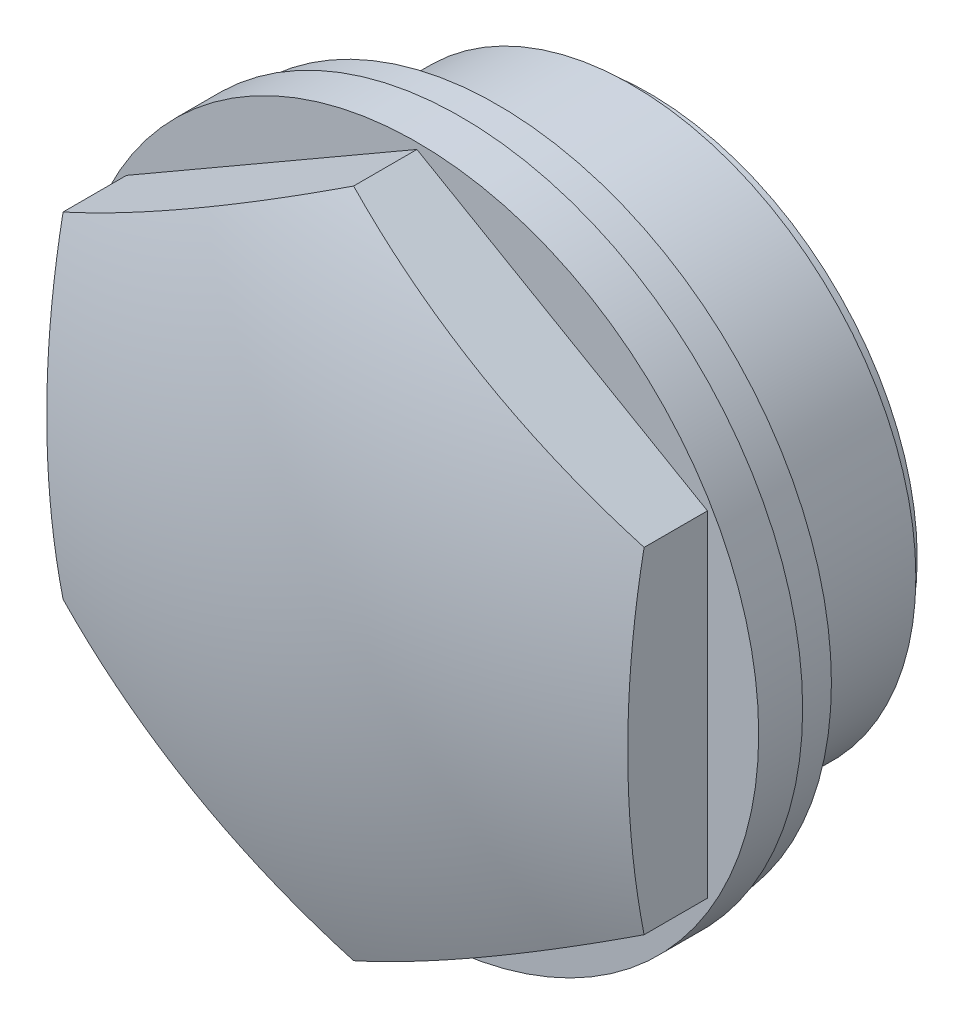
ISO-10303-21;
HEADER;
FILE_DESCRIPTION(('STEP AP214'),'2;1');
FILE_NAME('part.step','',(''),(''),'','','');
FILE_SCHEMA(('AUTOMOTIVE_DESIGN { 1 0 10303 214 1 1 1 1 }'));
ENDSEC;
DATA;
#1=APPLICATION_CONTEXT('core data for automotive mechanical design processes');
#2=APPLICATION_PROTOCOL_DEFINITION('international standard','automotive_design',2000,#1);
#3=PRODUCT_CONTEXT('',#1,'mechanical');
#4=PRODUCT('Part','Part','',(#3));
#5=PRODUCT_RELATED_PRODUCT_CATEGORY('part','',(#4));
#6=PRODUCT_DEFINITION_FORMATION('','',#4);
#7=PRODUCT_DEFINITION_CONTEXT('part definition',#1,'design');
#8=PRODUCT_DEFINITION('design','',#6,#7);
#9=PRODUCT_DEFINITION_SHAPE('','',#8);
#10=(LENGTH_UNIT() NAMED_UNIT(*) SI_UNIT(.MILLI.,.METRE.));
#11=(NAMED_UNIT(*) PLANE_ANGLE_UNIT() SI_UNIT($,.RADIAN.));
#12=(NAMED_UNIT(*) SI_UNIT($,.STERADIAN.) SOLID_ANGLE_UNIT());
#13=UNCERTAINTY_MEASURE_WITH_UNIT(LENGTH_MEASURE(1.E-05),#10,'distance_accuracy_value','');
#14=(GEOMETRIC_REPRESENTATION_CONTEXT(3) GLOBAL_UNCERTAINTY_ASSIGNED_CONTEXT((#13)) GLOBAL_UNIT_ASSIGNED_CONTEXT((#10,
#11,#12)) REPRESENTATION_CONTEXT('',''));
#15=CARTESIAN_POINT('',(0.,0.,0.));
#16=DIRECTION('',(0.,0.,1.));
#17=DIRECTION('',(1.,0.,0.));
#18=AXIS2_PLACEMENT_3D('',#15,#16,#17);
#19=CARTESIAN_POINT('',(0.,0.,12.143));
#20=DIRECTION('',(0.,0.,1.));
#21=DIRECTION('',(1.,0.,0.));
#22=AXIS2_PLACEMENT_3D('',#19,#20,#21);
#23=CYLINDRICAL_SURFACE('',#22,20.);
#24=CARTESIAN_POINT('',(0.,0.,4.71501646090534));
#25=DIRECTION('',(0.,0.,1.));
#26=DIRECTION('',(1.,0.,0.));
#27=AXIS2_PLACEMENT_3D('',#24,#25,#26);
#28=CIRCLE('',#27,20.);
#29=CARTESIAN_POINT('',(20.,0.,4.71501646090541));
#30=VERTEX_POINT('',#29);
#31=EDGE_CURVE('E141',#30,#30,#28,.T.);
#32=ORIENTED_EDGE('',*,*,#31,.F.);
#33=EDGE_LOOP('',(#32));
#34=FACE_BOUND('',#33,.T.);
#35=CARTESIAN_POINT('',(0.,0.,2.143));
#36=DIRECTION('',(0.,0.,1.));
#37=DIRECTION('',(1.,0.,0.));
#38=AXIS2_PLACEMENT_3D('',#35,#36,#37);
#39=CIRCLE('',#38,20.);
#40=CARTESIAN_POINT('',(20.,0.,2.14300000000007));
#41=VERTEX_POINT('',#40);
#42=EDGE_CURVE('E109',#41,#41,#39,.T.);
#43=ORIENTED_EDGE('',*,*,#42,.T.);
#44=EDGE_LOOP('',(#43));
#45=FACE_BOUND('',#44,.T.);
#46=ADVANCED_FACE('F14',(#34,#45),#23,.T.);
#47=CARTESIAN_POINT('',(1.22690654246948E-13,0.,-43.997));
#48=DIRECTION('',(0.,0.,1.));
#49=DIRECTION('',(0.,-1.,0.));
#50=AXIS2_PLACEMENT_3D('',#47,#48,#49);
#51=SPHERICAL_SURFACE('',#50,53.64);
#52=CARTESIAN_POINT('',(0.,0.,8.0927681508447));
#53=DIRECTION('',(0.,0.,1.));
#54=DIRECTION('',(1.,0.,0.));
#55=AXIS2_PLACEMENT_3D('',#52,#53,#54);
#56=CIRCLE('',#55,12.8025643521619);
#57=CARTESIAN_POINT('',(12.8025643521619,0.,8.09276815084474));
#58=VERTEX_POINT('',#57);
#59=EDGE_CURVE('E133',#58,#58,#56,.T.);
#60=ORIENTED_EDGE('',*,*,#59,.F.);
#61=EDGE_LOOP('',(#60));
#62=FACE_BOUND('',#61,.T.);
#63=ADVANCED_FACE('F16',(#62),#51,.F.);
#64=CARTESIAN_POINT('',(0.,0.,8.0927681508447));
#65=DIRECTION('',(0.,0.,-1.));
#66=DIRECTION('',(-1.,0.,0.));
#67=AXIS2_PLACEMENT_3D('',#64,#65,#66);
#68=CONICAL_SURFACE('',#67,12.8025643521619,0.0349065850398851);
#69=CARTESIAN_POINT('',(0.,0.,-8.857));
#70=DIRECTION('',(0.,0.,1.));
#71=DIRECTION('',(1.,0.,0.));
#72=AXIS2_PLACEMENT_3D('',#69,#70,#71);
#73=CIRCLE('',#72,13.3944632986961);
#74=CARTESIAN_POINT('',(13.3944632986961,0.,-8.85699999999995));
#75=VERTEX_POINT('',#74);
#76=EDGE_CURVE('E130',#75,#75,#73,.T.);
#77=ORIENTED_EDGE('',*,*,#76,.F.);
#78=EDGE_LOOP('',(#77));
#79=FACE_BOUND('',#78,.T.);
#80=ORIENTED_EDGE('',*,*,#59,.T.);
#81=EDGE_LOOP('',(#80));
#82=FACE_BOUND('',#81,.T.);
#83=ADVANCED_FACE('F172',(#79,#82),#68,.F.);
#84=CARTESIAN_POINT('',(0.,13.3944632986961,-8.857));
#85=DIRECTION('',(0.,0.,1.));
#86=DIRECTION('',(1.,0.,0.));
#87=AXIS2_PLACEMENT_3D('',#84,#85,#86);
#88=PLANE('',#87);
#89=CARTESIAN_POINT('',(0.,0.,-8.857));
#90=DIRECTION('',(0.,0.,1.));
#91=DIRECTION('',(1.,0.,0.));
#92=AXIS2_PLACEMENT_3D('',#89,#90,#91);
#93=CIRCLE('',#92,15.7048475);
#94=CARTESIAN_POINT('',(15.7048475,0.,-8.85699999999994));
#95=VERTEX_POINT('',#94);
#96=EDGE_CURVE('E127',#95,#95,#93,.T.);
#97=ORIENTED_EDGE('',*,*,#96,.F.);
#98=EDGE_LOOP('',(#97));
#99=FACE_BOUND('',#98,.T.);
#100=ORIENTED_EDGE('',*,*,#76,.T.);
#101=EDGE_LOOP('',(#100));
#102=FACE_BOUND('',#101,.T.);
#103=ADVANCED_FACE('F202',(#99,#102),#88,.F.);
#104=CARTESIAN_POINT('',(0.,0.,12.143));
#105=DIRECTION('',(0.,0.,1.));
#106=DIRECTION('',(1.,0.,0.));
#107=AXIS2_PLACEMENT_3D('',#104,#105,#106);
#108=CYLINDRICAL_SURFACE('',#107,15.7048475);
#109=CARTESIAN_POINT('',(0.,0.,-7.857));
#110=DIRECTION('',(0.,0.,1.));
#111=DIRECTION('',(1.,0.,0.));
#112=AXIS2_PLACEMENT_3D('',#109,#110,#111);
#113=CIRCLE('',#112,15.7048475);
#114=CARTESIAN_POINT('',(15.7048475,0.,-7.85699999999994));
#115=VERTEX_POINT('',#114);
#116=EDGE_CURVE('E124',#115,#115,#113,.T.);
#117=ORIENTED_EDGE('',*,*,#116,.F.);
#118=EDGE_LOOP('',(#117));
#119=FACE_BOUND('',#118,.T.);
#120=ORIENTED_EDGE('',*,*,#96,.T.);
#121=EDGE_LOOP('',(#120));
#122=FACE_BOUND('',#121,.T.);
#123=ADVANCED_FACE('F198',(#119,#122),#108,.T.);
#124=CARTESIAN_POINT('',(0.,15.7048475,-7.857));
#125=DIRECTION('',(0.,0.,1.));
#126=DIRECTION('',(1.,0.,0.));
#127=AXIS2_PLACEMENT_3D('',#124,#125,#126);
#128=PLANE('',#127);
#129=CARTESIAN_POINT('',(0.,0.,-7.857));
#130=DIRECTION('',(0.,0.,1.));
#131=DIRECTION('',(1.,0.,0.));
#132=AXIS2_PLACEMENT_3D('',#129,#130,#131);
#133=CIRCLE('',#132,16.625);
#134=CARTESIAN_POINT('',(16.625,0.,-7.85699999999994));
#135=VERTEX_POINT('',#134);
#136=EDGE_CURVE('E121',#135,#135,#133,.T.);
#137=ORIENTED_EDGE('',*,*,#136,.F.);
#138=EDGE_LOOP('',(#137));
#139=FACE_BOUND('',#138,.T.);
#140=ORIENTED_EDGE('',*,*,#116,.T.);
#141=EDGE_LOOP('',(#140));
#142=FACE_BOUND('',#141,.T.);
#143=ADVANCED_FACE('F194',(#139,#142),#128,.F.);
#144=CARTESIAN_POINT('',(0.,0.,12.143));
#145=DIRECTION('',(0.,0.,1.));
#146=DIRECTION('',(1.,0.,0.));
#147=AXIS2_PLACEMENT_3D('',#144,#145,#146);
#148=CYLINDRICAL_SURFACE('',#147,16.625);
#149=CARTESIAN_POINT('',(0.,0.,-0.000163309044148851));
#150=DIRECTION('',(0.,0.,1.));
#151=DIRECTION('',(1.,0.,0.));
#152=AXIS2_PLACEMENT_3D('',#149,#150,#151);
#153=CIRCLE('',#152,16.625);
#154=CARTESIAN_POINT('',(16.625,0.,-0.000163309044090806));
#155=VERTEX_POINT('',#154);
#156=EDGE_CURVE('E118',#155,#155,#153,.T.);
#157=ORIENTED_EDGE('',*,*,#156,.F.);
#158=EDGE_LOOP('',(#157));
#159=FACE_BOUND('',#158,.T.);
#160=ORIENTED_EDGE('',*,*,#136,.T.);
#161=EDGE_LOOP('',(#160));
#162=FACE_BOUND('',#161,.T.);
#163=ADVANCED_FACE('F190',(#159,#162),#148,.T.);
#164=CARTESIAN_POINT('',(0.,16.625,-0.000163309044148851));
#165=DIRECTION('',(0.,0.,1.));
#166=DIRECTION('',(1.,0.,0.));
#167=AXIS2_PLACEMENT_3D('',#164,#165,#166);
#168=PLANE('',#167);
#169=CARTESIAN_POINT('',(0.,0.,-0.000163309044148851));
#170=DIRECTION('',(0.,0.,1.));
#171=DIRECTION('',(1.,0.,0.));
#172=AXIS2_PLACEMENT_3D('',#169,#170,#171);
#173=CIRCLE('',#172,19.54);
#174=CARTESIAN_POINT('',(19.54,0.,-0.000163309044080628));
#175=VERTEX_POINT('',#174);
#176=EDGE_CURVE('E115',#175,#175,#173,.T.);
#177=ORIENTED_EDGE('',*,*,#176,.F.);
#178=EDGE_LOOP('',(#177));
#179=FACE_BOUND('',#178,.T.);
#180=ORIENTED_EDGE('',*,*,#156,.T.);
#181=EDGE_LOOP('',(#180));
#182=FACE_BOUND('',#181,.T.);
#183=ADVANCED_FACE('F186',(#179,#182),#168,.F.);
#184=CARTESIAN_POINT('',(0.,0.,12.143));
#185=DIRECTION('',(0.,0.,1.));
#186=DIRECTION('',(1.,0.,0.));
#187=AXIS2_PLACEMENT_3D('',#184,#185,#186);
#188=CYLINDRICAL_SURFACE('',#187,19.54);
#189=CARTESIAN_POINT('',(0.,0.,2.143));
#190=DIRECTION('',(0.,0.,1.));
#191=DIRECTION('',(1.,0.,0.));
#192=AXIS2_PLACEMENT_3D('',#189,#190,#191);
#193=CIRCLE('',#192,19.54);
#194=CARTESIAN_POINT('',(19.54,0.,2.14300000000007));
#195=VERTEX_POINT('',#194);
#196=EDGE_CURVE('E112',#195,#195,#193,.T.);
#197=ORIENTED_EDGE('',*,*,#196,.F.);
#198=EDGE_LOOP('',(#197));
#199=FACE_BOUND('',#198,.T.);
#200=ORIENTED_EDGE('',*,*,#176,.T.);
#201=EDGE_LOOP('',(#200));
#202=FACE_BOUND('',#201,.T.);
#203=ADVANCED_FACE('F182',(#199,#202),#188,.T.);
#204=CARTESIAN_POINT('',(0.,19.54,2.143));
#205=DIRECTION('',(0.,0.,1.));
#206=DIRECTION('',(1.,0.,0.));
#207=AXIS2_PLACEMENT_3D('',#204,#205,#206);
#208=PLANE('',#207);
#209=ORIENTED_EDGE('',*,*,#42,.F.);
#210=EDGE_LOOP('',(#209));
#211=FACE_BOUND('',#210,.T.);
#212=ORIENTED_EDGE('',*,*,#196,.T.);
#213=EDGE_LOOP('',(#212));
#214=FACE_BOUND('',#213,.T.);
#215=ADVANCED_FACE('F179',(#211,#214),#208,.F.);
#216=CARTESIAN_POINT('',(1.1396195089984E-13,0.,-41.497));
#217=DIRECTION('',(0.,0.,1.));
#218=DIRECTION('',(0.,1.,0.));
#219=AXIS2_PLACEMENT_3D('',#216,#217,#218);
#220=SPHERICAL_SURFACE('',#219,53.64);
#221=CARTESIAN_POINT('',(8.50000000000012,14.7224318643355,-41.497));
#222=DIRECTION('',(-0.5,-0.866025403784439,0.));
#223=DIRECTION('',(0.86602540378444,-0.5,0.));
#224=AXIS2_PLACEMENT_3D('',#221,#222,#223);
#225=CIRCLE('',#224,50.8748425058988);
#226=CARTESIAN_POINT('',(0.,19.6299091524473,8.42209721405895));
#227=VERTEX_POINT('',#226);
#228=CARTESIAN_POINT('',(17.,9.81495457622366,8.42209721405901));
#229=VERTEX_POINT('',#228);
#230=EDGE_CURVE('E85',#227,#229,#225,.F.);
#231=ORIENTED_EDGE('',*,*,#230,.F.);
#232=CARTESIAN_POINT('',(-8.49999999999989,14.7224318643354,-41.497));
#233=DIRECTION('',(0.5,-0.866025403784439,0.));
#234=DIRECTION('',(0.866025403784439,0.5,0.));
#235=AXIS2_PLACEMENT_3D('',#232,#233,#234);
#236=CIRCLE('',#235,50.8748425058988);
#237=CARTESIAN_POINT('',(-17.,9.81495457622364,8.42209721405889));
#238=VERTEX_POINT('',#237);
#239=EDGE_CURVE('E136',#238,#227,#236,.F.);
#240=ORIENTED_EDGE('',*,*,#239,.F.);
#241=CARTESIAN_POINT('',(-17.,0.,-41.497));
#242=DIRECTION('',(1.,0.,0.));
#243=DIRECTION('',(0.,0.,-1.));
#244=AXIS2_PLACEMENT_3D('',#241,#242,#243);
#245=CIRCLE('',#244,50.8748425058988);
#246=CARTESIAN_POINT('',(-17.,-9.81495457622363,8.42209721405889));
#247=VERTEX_POINT('',#246);
#248=EDGE_CURVE('E36',#247,#238,#245,.F.);
#249=ORIENTED_EDGE('',*,*,#248,.F.);
#250=CARTESIAN_POINT('',(-8.49999999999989,-14.7224318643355,-41.497));
#251=DIRECTION('',(0.5,0.866025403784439,0.));
#252=DIRECTION('',(-0.866025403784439,0.5,0.));
#253=AXIS2_PLACEMENT_3D('',#250,#251,#252);
#254=CIRCLE('',#253,50.8748425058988);
#255=CARTESIAN_POINT('',(0.,-19.6299091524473,8.42209721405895));
#256=VERTEX_POINT('',#255);
#257=EDGE_CURVE('E29',#256,#247,#254,.F.);
#258=ORIENTED_EDGE('',*,*,#257,.F.);
#259=CARTESIAN_POINT('',(8.50000000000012,-14.7224318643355,-41.497));
#260=DIRECTION('',(-0.5,0.866025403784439,0.));
#261=DIRECTION('',(-0.866025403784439,-0.5,0.));
#262=AXIS2_PLACEMENT_3D('',#259,#260,#261);
#263=CIRCLE('',#262,50.8748425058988);
#264=CARTESIAN_POINT('',(17.,-9.81495457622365,8.42209721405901));
#265=VERTEX_POINT('',#264);
#266=EDGE_CURVE('E98',#265,#256,#263,.F.);
#267=ORIENTED_EDGE('',*,*,#266,.F.);
#268=CARTESIAN_POINT('',(17.,0.,-41.497));
#269=DIRECTION('',(-1.,0.,0.));
#270=DIRECTION('',(0.,0.,1.));
#271=AXIS2_PLACEMENT_3D('',#268,#269,#270);
#272=CIRCLE('',#271,50.8748425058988);
#273=EDGE_CURVE('E9',#229,#265,#272,.F.);
#274=ORIENTED_EDGE('',*,*,#273,.F.);
#275=EDGE_LOOP('',(#231,#240,#249,#258,#267,#274));
#276=FACE_BOUND('',#275,.T.);
#277=ADVANCED_FACE('F150',(#276),#220,.T.);
#278=CARTESIAN_POINT('',(0.,0.,4.71501646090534));
#279=DIRECTION('',(0.,0.,1.));
#280=DIRECTION('',(1.,0.,0.));
#281=AXIS2_PLACEMENT_3D('',#278,#279,#280);
#282=PLANE('',#281);
#283=ORIENTED_EDGE('',*,*,#31,.T.);
#284=EDGE_LOOP('',(#283));
#285=FACE_BOUND('',#284,.T.);
#286=DIRECTION('',(0.866025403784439,0.5,0.));
#287=VECTOR('',#286,1.);
#288=CARTESIAN_POINT('',(-17.,9.81495457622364,4.71501646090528));
#289=LINE('',#288,#287);
#290=CARTESIAN_POINT('',(-17.,9.81495457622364,4.71501646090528));
#291=VERTEX_POINT('',#290);
#292=CARTESIAN_POINT('',(0.,19.6299091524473,4.71501646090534));
#293=VERTEX_POINT('',#292);
#294=EDGE_CURVE('E77',#291,#293,#289,.T.);
#295=ORIENTED_EDGE('',*,*,#294,.T.);
#296=DIRECTION('',(0.86602540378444,-0.5,0.));
#297=VECTOR('',#296,1.);
#298=CARTESIAN_POINT('',(-0.100000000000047,19.6876441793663,4.71501646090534));
#299=LINE('',#298,#297);
#300=CARTESIAN_POINT('',(17.,9.81495457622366,4.7150164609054));
#301=VERTEX_POINT('',#300);
#302=EDGE_CURVE('E68',#293,#301,#299,.T.);
#303=ORIENTED_EDGE('',*,*,#302,.T.);
#304=DIRECTION('',(0.,-1.,0.));
#305=VECTOR('',#304,1.);
#306=CARTESIAN_POINT('',(17.,9.81495457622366,4.7150164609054));
#307=LINE('',#306,#305);
#308=CARTESIAN_POINT('',(17.,-9.81495457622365,4.7150164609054));
#309=VERTEX_POINT('',#308);
#310=EDGE_CURVE('E73',#301,#309,#307,.T.);
#311=ORIENTED_EDGE('',*,*,#310,.T.);
#312=DIRECTION('',(-0.866025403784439,-0.5,0.));
#313=VECTOR('',#312,1.);
#314=CARTESIAN_POINT('',(17.,-9.81495457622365,4.7150164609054));
#315=LINE('',#314,#313);
#316=CARTESIAN_POINT('',(0.,-19.6299091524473,4.71501646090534));
#317=VERTEX_POINT('',#316);
#318=EDGE_CURVE('E92',#309,#317,#315,.T.);
#319=ORIENTED_EDGE('',*,*,#318,.T.);
#320=DIRECTION('',(-0.866025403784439,0.5,0.));
#321=VECTOR('',#320,1.);
#322=CARTESIAN_POINT('',(0.099999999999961,-19.6876441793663,4.71501646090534));
#323=LINE('',#322,#321);
#324=CARTESIAN_POINT('',(-17.,-9.81495457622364,4.71501646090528));
#325=VERTEX_POINT('',#324);
#326=EDGE_CURVE('E100',#317,#325,#323,.T.);
#327=ORIENTED_EDGE('',*,*,#326,.T.);
#328=DIRECTION('',(0.,1.,0.));
#329=VECTOR('',#328,1.);
#330=CARTESIAN_POINT('',(-17.,-9.81495457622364,4.71501646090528));
#331=LINE('',#330,#329);
#332=EDGE_CURVE('E102',#325,#291,#331,.T.);
#333=ORIENTED_EDGE('',*,*,#332,.T.);
#334=EDGE_LOOP('',(#295,#303,#311,#319,#327,#333));
#335=FACE_BOUND('',#334,.T.);
#336=ADVANCED_FACE('F70',(#285,#335),#282,.T.);
#337=CARTESIAN_POINT('',(0.099999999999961,-19.6876441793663,4.71501646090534));
#338=DIRECTION('',(0.5,0.866025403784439,0.));
#339=DIRECTION('',(-0.866025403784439,0.5,0.));
#340=AXIS2_PLACEMENT_3D('',#337,#338,#339);
#341=PLANE('',#340);
#342=ORIENTED_EDGE('',*,*,#326,.F.);
#343=DIRECTION('',(0.,0.,1.));
#344=VECTOR('',#343,1.);
#345=CARTESIAN_POINT('',(0.,-19.6299091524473,4.71501646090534));
#346=LINE('',#345,#344);
#347=EDGE_CURVE('E22',#317,#256,#346,.T.);
#348=ORIENTED_EDGE('',*,*,#347,.T.);
#349=ORIENTED_EDGE('',*,*,#257,.T.);
#350=DIRECTION('',(0.,0.,1.));
#351=VECTOR('',#350,1.);
#352=CARTESIAN_POINT('',(-17.,-9.81495457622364,4.71501646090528));
#353=LINE('',#352,#351);
#354=EDGE_CURVE('E107',#325,#247,#353,.T.);
#355=ORIENTED_EDGE('',*,*,#354,.F.);
#356=EDGE_LOOP('',(#342,#348,#349,#355));
#357=FACE_BOUND('',#356,.T.);
#358=ADVANCED_FACE('F146',(#357),#341,.F.);
#359=CARTESIAN_POINT('',(-17.,-9.81495457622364,4.71501646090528));
#360=DIRECTION('',(1.,0.,0.));
#361=DIRECTION('',(0.,0.,-1.));
#362=AXIS2_PLACEMENT_3D('',#359,#360,#361);
#363=PLANE('',#362);
#364=ORIENTED_EDGE('',*,*,#248,.T.);
#365=DIRECTION('',(0.,0.,1.));
#366=VECTOR('',#365,1.);
#367=CARTESIAN_POINT('',(-17.,9.81495457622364,4.71501646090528));
#368=LINE('',#367,#366);
#369=EDGE_CURVE('E105',#291,#238,#368,.T.);
#370=ORIENTED_EDGE('',*,*,#369,.F.);
#371=ORIENTED_EDGE('',*,*,#332,.F.);
#372=ORIENTED_EDGE('',*,*,#354,.T.);
#373=EDGE_LOOP('',(#364,#370,#371,#372));
#374=FACE_BOUND('',#373,.T.);
#375=ADVANCED_FACE('F155',(#374),#363,.F.);
#376=CARTESIAN_POINT('',(-17.,9.81495457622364,4.71501646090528));
#377=DIRECTION('',(0.5,-0.866025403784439,0.));
#378=DIRECTION('',(0.866025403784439,0.5,0.));
#379=AXIS2_PLACEMENT_3D('',#376,#377,#378);
#380=PLANE('',#379);
#381=ORIENTED_EDGE('',*,*,#239,.T.);
#382=DIRECTION('',(0.,0.,-1.));
#383=VECTOR('',#382,1.);
#384=CARTESIAN_POINT('',(0.,19.6299091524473,4.71501646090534));
#385=LINE('',#384,#383);
#386=EDGE_CURVE('E144',#227,#293,#385,.T.);
#387=ORIENTED_EDGE('',*,*,#386,.T.);
#388=ORIENTED_EDGE('',*,*,#294,.F.);
#389=ORIENTED_EDGE('',*,*,#369,.T.);
#390=EDGE_LOOP('',(#381,#387,#388,#389));
#391=FACE_BOUND('',#390,.T.);
#392=ADVANCED_FACE('F153',(#391),#380,.F.);
#393=CARTESIAN_POINT('',(-0.100000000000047,19.6876441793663,4.71501646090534));
#394=DIRECTION('',(-0.5,-0.866025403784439,0.));
#395=DIRECTION('',(0.86602540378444,-0.5,0.));
#396=AXIS2_PLACEMENT_3D('',#393,#394,#395);
#397=PLANE('',#396);
#398=ORIENTED_EDGE('',*,*,#230,.T.);
#399=DIRECTION('',(0.,0.,1.));
#400=VECTOR('',#399,1.);
#401=CARTESIAN_POINT('',(17.,9.81495457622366,4.7150164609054));
#402=LINE('',#401,#400);
#403=EDGE_CURVE('E82',#301,#229,#402,.T.);
#404=ORIENTED_EDGE('',*,*,#403,.F.);
#405=ORIENTED_EDGE('',*,*,#302,.F.);
#406=ORIENTED_EDGE('',*,*,#386,.F.);
#407=EDGE_LOOP('',(#398,#404,#405,#406));
#408=FACE_BOUND('',#407,.T.);
#409=ADVANCED_FACE('F83',(#408),#397,.F.);
#410=CARTESIAN_POINT('',(17.,9.81495457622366,4.7150164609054));
#411=DIRECTION('',(-1.,0.,0.));
#412=DIRECTION('',(0.,0.,1.));
#413=AXIS2_PLACEMENT_3D('',#410,#411,#412);
#414=PLANE('',#413);
#415=ORIENTED_EDGE('',*,*,#273,.T.);
#416=DIRECTION('',(0.,0.,1.));
#417=VECTOR('',#416,1.);
#418=CARTESIAN_POINT('',(17.,-9.81495457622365,4.7150164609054));
#419=LINE('',#418,#417);
#420=EDGE_CURVE('E88',#309,#265,#419,.T.);
#421=ORIENTED_EDGE('',*,*,#420,.F.);
#422=ORIENTED_EDGE('',*,*,#310,.F.);
#423=ORIENTED_EDGE('',*,*,#403,.T.);
#424=EDGE_LOOP('',(#415,#421,#422,#423));
#425=FACE_BOUND('',#424,.T.);
#426=ADVANCED_FACE('F90',(#425),#414,.F.);
#427=CARTESIAN_POINT('',(17.,-9.81495457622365,4.7150164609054));
#428=DIRECTION('',(-0.5,0.866025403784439,0.));
#429=DIRECTION('',(-0.866025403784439,-0.5,0.));
#430=AXIS2_PLACEMENT_3D('',#427,#428,#429);
#431=PLANE('',#430);
#432=ORIENTED_EDGE('',*,*,#266,.T.);
#433=ORIENTED_EDGE('',*,*,#347,.F.);
#434=ORIENTED_EDGE('',*,*,#318,.F.);
#435=ORIENTED_EDGE('',*,*,#420,.T.);
#436=EDGE_LOOP('',(#432,#433,#434,#435));
#437=FACE_BOUND('',#436,.T.);
#438=ADVANCED_FACE('F156',(#437),#431,.F.);
#439=CLOSED_SHELL('',(#46,#63,#83,#103,#123,#143,#163,#183,#203,#215,#277,#336,#358,#375,#392,
#409,#426,#438));
#440=MANIFOLD_SOLID_BREP('B1',#439);
#441=ADVANCED_BREP_SHAPE_REPRESENTATION('',(#18,#440),#14);
#442=SHAPE_DEFINITION_REPRESENTATION(#9,#441);
ENDSEC;
END-ISO-10303-21;
